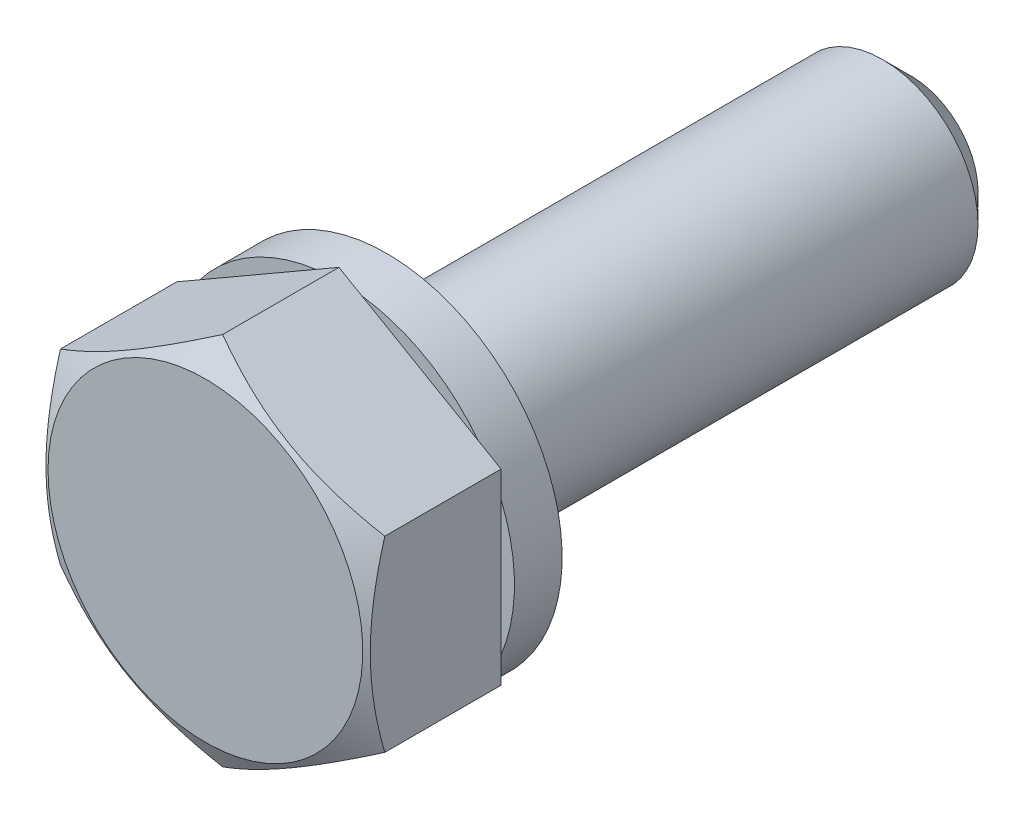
ISO-10303-21;
HEADER;
FILE_DESCRIPTION(('STEP AP214'),'2;1');
FILE_NAME('part.step','',(''),(''),'','','');
FILE_SCHEMA(('AUTOMOTIVE_DESIGN { 1 0 10303 214 1 1 1 1 }'));
ENDSEC;
DATA;
#1=APPLICATION_CONTEXT('core data for automotive mechanical design processes');
#2=APPLICATION_PROTOCOL_DEFINITION('international standard','automotive_design',2000,#1);
#3=PRODUCT_CONTEXT('',#1,'mechanical');
#4=PRODUCT('Part','Part','',(#3));
#5=PRODUCT_RELATED_PRODUCT_CATEGORY('part','',(#4));
#6=PRODUCT_DEFINITION_FORMATION('','',#4);
#7=PRODUCT_DEFINITION_CONTEXT('part definition',#1,'design');
#8=PRODUCT_DEFINITION('design','',#6,#7);
#9=PRODUCT_DEFINITION_SHAPE('','',#8);
#10=(LENGTH_UNIT() NAMED_UNIT(*) SI_UNIT(.MILLI.,.METRE.));
#11=(NAMED_UNIT(*) PLANE_ANGLE_UNIT() SI_UNIT($,.RADIAN.));
#12=(NAMED_UNIT(*) SI_UNIT($,.STERADIAN.) SOLID_ANGLE_UNIT());
#13=UNCERTAINTY_MEASURE_WITH_UNIT(LENGTH_MEASURE(1.E-05),#10,'distance_accuracy_value','');
#14=(GEOMETRIC_REPRESENTATION_CONTEXT(3) GLOBAL_UNCERTAINTY_ASSIGNED_CONTEXT((#13)) GLOBAL_UNIT_ASSIGNED_CONTEXT((#10,
#11,#12)) REPRESENTATION_CONTEXT('',''));
#15=CARTESIAN_POINT('',(0.,0.,0.));
#16=DIRECTION('',(0.,0.,1.));
#17=DIRECTION('',(1.,0.,0.));
#18=AXIS2_PLACEMENT_3D('',#15,#16,#17);
#19=CARTESIAN_POINT('',(0.,9.81495457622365,0.));
#20=DIRECTION('',(0.,0.,1.));
#21=DIRECTION('',(1.,0.,0.));
#22=AXIS2_PLACEMENT_3D('',#19,#20,#21);
#23=PLANE('',#22);
#24=CARTESIAN_POINT('',(0.,0.,0.));
#25=DIRECTION('',(0.,0.,-1.));
#26=DIRECTION('',(-1.,0.,0.));
#27=AXIS2_PLACEMENT_3D('',#24,#25,#26);
#28=CIRCLE('',#27,5.1);
#29=CARTESIAN_POINT('',(-5.1,0.,0.));
#30=VERTEX_POINT('',#29);
#31=EDGE_CURVE('E331',#30,#30,#28,.T.);
#32=ORIENTED_EDGE('',*,*,#31,.T.);
#33=EDGE_LOOP('',(#32));
#34=FACE_BOUND('',#33,.T.);
#35=CARTESIAN_POINT('',(0.,0.,0.));
#36=DIRECTION('',(0.,0.,1.));
#37=DIRECTION('',(1.,0.,0.));
#38=AXIS2_PLACEMENT_3D('',#35,#36,#37);
#39=CIRCLE('',#38,5.);
#40=CARTESIAN_POINT('',(5.,0.,0.));
#41=VERTEX_POINT('',#40);
#42=EDGE_CURVE('E175',#41,#41,#39,.F.);
#43=ORIENTED_EDGE('',*,*,#42,.F.);
#44=EDGE_LOOP('',(#43));
#45=FACE_BOUND('',#44,.T.);
#46=ADVANCED_FACE('F14',(#34,#45),#23,.F.);
#47=CARTESIAN_POINT('',(0.,0.,-30.));
#48=DIRECTION('',(0.,0.,1.));
#49=DIRECTION('',(1.,0.,0.));
#50=AXIS2_PLACEMENT_3D('',#47,#48,#49);
#51=CYLINDRICAL_SURFACE('',#50,5.);
#52=CARTESIAN_POINT('',(0.,0.,-28.5));
#53=DIRECTION('',(0.,0.,-1.));
#54=DIRECTION('',(-1.,0.,0.));
#55=AXIS2_PLACEMENT_3D('',#52,#53,#54);
#56=CIRCLE('',#55,5.);
#57=CARTESIAN_POINT('',(-5.,0.,-28.5));
#58=VERTEX_POINT('',#57);
#59=EDGE_CURVE('E9',#58,#58,#56,.F.);
#60=ORIENTED_EDGE('',*,*,#59,.T.);
#61=EDGE_LOOP('',(#60));
#62=FACE_BOUND('',#61,.T.);
#63=ORIENTED_EDGE('',*,*,#42,.T.);
#64=EDGE_LOOP('',(#63));
#65=FACE_BOUND('',#64,.T.);
#66=ADVANCED_FACE('F195',(#62,#65),#51,.T.);
#67=CARTESIAN_POINT('',(0.,0.,-30.));
#68=DIRECTION('',(0.,0.,-1.));
#69=DIRECTION('',(-1.,0.,0.));
#70=AXIS2_PLACEMENT_3D('',#67,#68,#69);
#71=PLANE('',#70);
#72=CARTESIAN_POINT('',(0.,0.,-30.));
#73=DIRECTION('',(0.,0.,-1.));
#74=DIRECTION('',(-1.,0.,0.));
#75=AXIS2_PLACEMENT_3D('',#72,#73,#74);
#76=CIRCLE('',#75,3.5);
#77=CARTESIAN_POINT('',(-3.5,0.,-30.));
#78=VERTEX_POINT('',#77);
#79=EDGE_CURVE('E22',#78,#78,#76,.T.);
#80=ORIENTED_EDGE('',*,*,#79,.T.);
#81=EDGE_LOOP('',(#80));
#82=FACE_BOUND('',#81,.T.);
#83=ADVANCED_FACE('F180',(#82),#71,.T.);
#84=CARTESIAN_POINT('',(0.,0.,-30.));
#85=DIRECTION('',(0.,0.,1.));
#86=DIRECTION('',(1.,0.,0.));
#87=AXIS2_PLACEMENT_3D('',#84,#85,#86);
#88=CONICAL_SURFACE('',#87,3.5,0.785398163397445);
#89=ORIENTED_EDGE('',*,*,#59,.F.);
#90=EDGE_LOOP('',(#89));
#91=FACE_BOUND('',#90,.T.);
#92=ORIENTED_EDGE('',*,*,#79,.F.);
#93=EDGE_LOOP('',(#92));
#94=FACE_BOUND('',#93,.T.);
#95=ADVANCED_FACE('F16',(#91,#94),#88,.T.);
#96=CARTESIAN_POINT('',(0.,0.,0.));
#97=DIRECTION('',(0.,0.,-1.));
#98=DIRECTION('',(-1.,0.,0.));
#99=AXIS2_PLACEMENT_3D('',#96,#97,#98);
#100=PLANE('',#99);
#101=CARTESIAN_POINT('',(0.,0.,0.));
#102=DIRECTION('',(0.,0.,-1.));
#103=DIRECTION('',(-1.,0.,0.));
#104=AXIS2_PLACEMENT_3D('',#101,#102,#103);
#105=CIRCLE('',#104,9.2);
#106=CARTESIAN_POINT('',(1.20163978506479,9.12118752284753,0.));
#107=VERTEX_POINT('',#106);
#108=CARTESIAN_POINT('',(7.29836021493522,5.60124434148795,0.));
#109=VERTEX_POINT('',#108);
#110=EDGE_CURVE('E233',#107,#109,#105,.T.);
#111=ORIENTED_EDGE('',*,*,#110,.F.);
#112=DIRECTION('',(0.866025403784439,-0.5,0.));
#113=VECTOR('',#112,1.);
#114=CARTESIAN_POINT('',(8.5,4.90747728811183,0.));
#115=LINE('',#114,#113);
#116=EDGE_CURVE('E237',#107,#109,#115,.T.);
#117=ORIENTED_EDGE('',*,*,#116,.T.);
#118=EDGE_LOOP('',(#111,#117));
#119=FACE_BOUND('',#118,.T.);
#120=ADVANCED_FACE('F183',(#119),#100,.F.);
#121=CARTESIAN_POINT('',(-7.29836021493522,5.60124434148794,0.));
#122=VERTEX_POINT('',#121);
#123=CARTESIAN_POINT('',(-1.20163978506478,9.12118752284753,0.));
#124=VERTEX_POINT('',#123);
#125=EDGE_CURVE('E133',#122,#124,#105,.T.);
#126=ORIENTED_EDGE('',*,*,#125,.F.);
#127=DIRECTION('',(0.866025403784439,0.5,0.));
#128=VECTOR('',#127,1.);
#129=CARTESIAN_POINT('',(0.,9.81495457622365,0.));
#130=LINE('',#129,#128);
#131=EDGE_CURVE('E111',#122,#124,#130,.T.);
#132=ORIENTED_EDGE('',*,*,#131,.T.);
#133=EDGE_LOOP('',(#126,#132));
#134=FACE_BOUND('',#133,.T.);
#135=ADVANCED_FACE('F191',(#134),#100,.F.);
#136=CARTESIAN_POINT('',(-8.5,-3.51994318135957,0.));
#137=VERTEX_POINT('',#136);
#138=CARTESIAN_POINT('',(-8.5,3.51994318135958,0.));
#139=VERTEX_POINT('',#138);
#140=EDGE_CURVE('E107',#137,#139,#105,.T.);
#141=ORIENTED_EDGE('',*,*,#140,.F.);
#142=DIRECTION('',(0.,1.,0.));
#143=VECTOR('',#142,1.);
#144=CARTESIAN_POINT('',(-8.5,4.90747728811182,0.));
#145=LINE('',#144,#143);
#146=EDGE_CURVE('E104',#137,#139,#145,.T.);
#147=ORIENTED_EDGE('',*,*,#146,.T.);
#148=EDGE_LOOP('',(#141,#147));
#149=FACE_BOUND('',#148,.T.);
#150=ADVANCED_FACE('F106',(#149),#100,.F.);
#151=CARTESIAN_POINT('',(-1.20163978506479,-9.12118752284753,0.));
#152=VERTEX_POINT('',#151);
#153=CARTESIAN_POINT('',(-7.29836021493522,-5.60124434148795,0.));
#154=VERTEX_POINT('',#153);
#155=EDGE_CURVE('E525',#152,#154,#105,.T.);
#156=ORIENTED_EDGE('',*,*,#155,.F.);
#157=DIRECTION('',(-0.866025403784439,0.5,0.));
#158=VECTOR('',#157,1.);
#159=CARTESIAN_POINT('',(-8.5,-4.90747728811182,0.));
#160=LINE('',#159,#158);
#161=EDGE_CURVE('E112',#152,#154,#160,.T.);
#162=ORIENTED_EDGE('',*,*,#161,.T.);
#163=EDGE_LOOP('',(#156,#162));
#164=FACE_BOUND('',#163,.T.);
#165=ADVANCED_FACE('F435',(#164),#100,.F.);
#166=CARTESIAN_POINT('',(7.29836021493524,-5.60124434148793,0.));
#167=VERTEX_POINT('',#166);
#168=CARTESIAN_POINT('',(1.20163978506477,-9.12118752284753,0.));
#169=VERTEX_POINT('',#168);
#170=EDGE_CURVE('E524',#167,#169,#105,.T.);
#171=ORIENTED_EDGE('',*,*,#170,.F.);
#172=DIRECTION('',(-0.866025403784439,-0.5,0.));
#173=VECTOR('',#172,1.);
#174=CARTESIAN_POINT('',(0.,-9.81495457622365,0.));
#175=LINE('',#174,#173);
#176=EDGE_CURVE('E326',#167,#169,#175,.T.);
#177=ORIENTED_EDGE('',*,*,#176,.T.);
#178=EDGE_LOOP('',(#171,#177));
#179=FACE_BOUND('',#178,.T.);
#180=ADVANCED_FACE('F350',(#179),#100,.F.);
#181=CARTESIAN_POINT('',(8.5,3.5199431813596,0.));
#182=VERTEX_POINT('',#181);
#183=CARTESIAN_POINT('',(8.5,-3.5199431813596,0.));
#184=VERTEX_POINT('',#183);
#185=EDGE_CURVE('E234',#182,#184,#105,.T.);
#186=ORIENTED_EDGE('',*,*,#185,.F.);
#187=DIRECTION('',(0.,1.,0.));
#188=VECTOR('',#187,1.);
#189=CARTESIAN_POINT('',(8.5,-4.90747728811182,0.));
#190=LINE('',#189,#188);
#191=EDGE_CURVE('E159',#184,#182,#190,.T.);
#192=ORIENTED_EDGE('',*,*,#191,.F.);
#193=EDGE_LOOP('',(#186,#192));
#194=FACE_BOUND('',#193,.T.);
#195=ADVANCED_FACE('F194',(#194),#100,.F.);
#196=CARTESIAN_POINT('',(0.,0.,-2.5));
#197=DIRECTION('',(0.,0.,-1.));
#198=DIRECTION('',(-1.,0.,0.));
#199=AXIS2_PLACEMENT_3D('',#196,#197,#198);
#200=PLANE('',#199);
#201=CARTESIAN_POINT('',(0.,0.,-2.5));
#202=DIRECTION('',(0.,0.,-1.));
#203=DIRECTION('',(-1.,0.,0.));
#204=AXIS2_PLACEMENT_3D('',#201,#202,#203);
#205=CIRCLE('',#204,9.2);
#206=CARTESIAN_POINT('',(-9.2,0.,-2.5));
#207=VERTEX_POINT('',#206);
#208=EDGE_CURVE('E132',#207,#207,#205,.T.);
#209=ORIENTED_EDGE('',*,*,#208,.T.);
#210=EDGE_LOOP('',(#209));
#211=FACE_BOUND('',#210,.T.);
#212=CARTESIAN_POINT('',(0.,0.,-2.5));
#213=DIRECTION('',(0.,0.,-1.));
#214=DIRECTION('',(-1.,0.,0.));
#215=AXIS2_PLACEMENT_3D('',#212,#213,#214);
#216=CIRCLE('',#215,5.1);
#217=CARTESIAN_POINT('',(-5.1,0.,-2.5));
#218=VERTEX_POINT('',#217);
#219=EDGE_CURVE('E124',#218,#218,#216,.T.);
#220=ORIENTED_EDGE('',*,*,#219,.F.);
#221=EDGE_LOOP('',(#220));
#222=FACE_BOUND('',#221,.T.);
#223=ADVANCED_FACE('F339',(#211,#222),#200,.T.);
#224=CARTESIAN_POINT('',(0.,0.,-2.5));
#225=DIRECTION('',(0.,0.,1.));
#226=DIRECTION('',(1.,0.,0.));
#227=AXIS2_PLACEMENT_3D('',#224,#225,#226);
#228=CYLINDRICAL_SURFACE('',#227,9.2);
#229=ORIENTED_EDGE('',*,*,#208,.F.);
#230=EDGE_LOOP('',(#229));
#231=FACE_BOUND('',#230,.T.);
#232=EDGE_CURVE('E118',#139,#122,#105,.T.);
#233=ORIENTED_EDGE('',*,*,#232,.T.);
#234=ORIENTED_EDGE('',*,*,#125,.T.);
#235=EDGE_CURVE('E539',#124,#107,#105,.T.);
#236=ORIENTED_EDGE('',*,*,#235,.T.);
#237=ORIENTED_EDGE('',*,*,#110,.T.);
#238=EDGE_CURVE('E29',#109,#182,#105,.T.);
#239=ORIENTED_EDGE('',*,*,#238,.T.);
#240=ORIENTED_EDGE('',*,*,#185,.T.);
#241=EDGE_CURVE('E530',#184,#167,#105,.T.);
#242=ORIENTED_EDGE('',*,*,#241,.T.);
#243=ORIENTED_EDGE('',*,*,#170,.T.);
#244=EDGE_CURVE('E522',#169,#152,#105,.T.);
#245=ORIENTED_EDGE('',*,*,#244,.T.);
#246=ORIENTED_EDGE('',*,*,#155,.T.);
#247=EDGE_CURVE('E122',#154,#137,#105,.T.);
#248=ORIENTED_EDGE('',*,*,#247,.T.);
#249=ORIENTED_EDGE('',*,*,#140,.T.);
#250=EDGE_LOOP('',(#233,#234,#236,#237,#239,#240,#242,#243,#245,#246,#248,#249));
#251=FACE_BOUND('',#250,.T.);
#252=ADVANCED_FACE('F116',(#231,#251),#228,.T.);
#253=CARTESIAN_POINT('',(0.,0.,-2.5));
#254=DIRECTION('',(0.,0.,1.));
#255=DIRECTION('',(1.,0.,0.));
#256=AXIS2_PLACEMENT_3D('',#253,#254,#255);
#257=CYLINDRICAL_SURFACE('',#256,5.1);
#258=ORIENTED_EDGE('',*,*,#219,.T.);
#259=EDGE_LOOP('',(#258));
#260=FACE_BOUND('',#259,.T.);
#261=ORIENTED_EDGE('',*,*,#31,.F.);
#262=EDGE_LOOP('',(#261));
#263=FACE_BOUND('',#262,.T.);
#264=ADVANCED_FACE('F336',(#260,#263),#257,.F.);
#265=CARTESIAN_POINT('',(0.,9.81495457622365,7.));
#266=DIRECTION('',(0.,0.,1.));
#267=DIRECTION('',(1.,0.,0.));
#268=AXIS2_PLACEMENT_3D('',#265,#266,#267);
#269=PLANE('',#268);
#270=CARTESIAN_POINT('',(0.,0.,7.));
#271=DIRECTION('',(0.,0.,-1.));
#272=DIRECTION('',(-1.,0.,0.));
#273=AXIS2_PLACEMENT_3D('',#270,#271,#272);
#274=CIRCLE('',#273,8.25);
#275=CARTESIAN_POINT('',(-8.25,0.,7.));
#276=VERTEX_POINT('',#275);
#277=EDGE_CURVE('E309',#276,#276,#274,.T.);
#278=ORIENTED_EDGE('',*,*,#277,.F.);
#279=EDGE_LOOP('',(#278));
#280=FACE_BOUND('',#279,.T.);
#281=ADVANCED_FACE('F261',(#280),#269,.T.);
#282=CARTESIAN_POINT('',(0.,0.,7.));
#283=DIRECTION('',(0.,0.,-1.));
#284=DIRECTION('',(-1.,0.,0.));
#285=AXIS2_PLACEMENT_3D('',#282,#283,#284);
#286=CONICAL_SURFACE('',#285,8.25,1.0471975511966);
#287=ORIENTED_EDGE('',*,*,#277,.T.);
#288=EDGE_LOOP('',(#287));
#289=FACE_BOUND('',#288,.T.);
#290=CARTESIAN_POINT('',(-8.5002,4.90736181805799,6.09640638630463));
#291=CARTESIAN_POINT('',(-8.31336077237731,5.01523349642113,6.15867629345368));
#292=CARTESIAN_POINT('',(-8.1258249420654,5.12350735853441,6.21812013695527));
#293=CARTESIAN_POINT('',(-7.74923024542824,5.34093440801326,6.33057732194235));
#294=CARTESIAN_POINT('',(-7.56017075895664,5.4500879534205,6.38358788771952));
#295=CARTESIAN_POINT('',(-6.98996524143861,5.77929626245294,6.53192904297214));
#296=CARTESIAN_POINT('',(-6.60656835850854,6.00065055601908,6.61630350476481));
#297=CARTESIAN_POINT('',(-6.03282233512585,6.33190297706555,6.71524241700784));
#298=CARTESIAN_POINT('',(-5.84418723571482,6.44081150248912,6.7434272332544));
#299=CARTESIAN_POINT('',(-5.4660639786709,6.65912106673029,6.79068834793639));
#300=CARTESIAN_POINT('',(-5.27657589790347,6.76852206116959,6.80976545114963));
#301=CARTESIAN_POINT('',(-4.89727347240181,6.98751241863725,6.83832766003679));
#302=CARTESIAN_POINT('',(-4.70745974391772,7.09710142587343,6.84782365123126));
#303=CARTESIAN_POINT('',(-4.32765694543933,7.3163806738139,6.85702005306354));
#304=CARTESIAN_POINT('',(-4.13766788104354,7.42607091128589,6.85672076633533));
#305=CARTESIAN_POINT('',(-3.78247698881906,7.63114046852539,6.84700795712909));
#306=CARTESIAN_POINT('',(-3.61725009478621,7.72653426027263,6.83877926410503));
#307=CARTESIAN_POINT('',(-3.28718328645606,7.9170984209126,6.81507319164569));
#308=CARTESIAN_POINT('',(-3.12234339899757,8.01226877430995,6.79959532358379));
#309=CARTESIAN_POINT('',(-2.6284618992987,8.29741139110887,6.74265381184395));
#310=CARTESIAN_POINT('',(-2.3002944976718,8.48687892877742,6.69068937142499));
#311=CARTESIAN_POINT('',(-1.64047857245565,8.86782383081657,6.56077749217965));
#312=CARTESIAN_POINT('',(-1.30891425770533,9.05925257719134,6.48227936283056));
#313=CARTESIAN_POINT('',(-0.650730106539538,9.43925537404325,6.30412109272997));
#314=CARTESIAN_POINT('',(-0.32410184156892,9.62783429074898,6.20450279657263));
#315=CARTESIAN_POINT('',(0.000200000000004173,9.81507004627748,6.09640638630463));
#316=B_SPLINE_CURVE_WITH_KNOTS('',3,(#290,#291,#292,#293,#294,#295,#296,#297,#298,#299,#300,
#301,#302,#303,#304,#305,#306,#307,#308,#309,#310,#311,#312,#313,#314,#315),.UNSPECIFIED.,.F.,
.F.,(4,2,2,2,2,2,2,2,2,2,2,2,4),(0.,0.673596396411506,1.34748239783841,2.69805431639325,
3.35679995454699,4.01548737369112,4.67342558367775,5.33134346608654,5.90409556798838,
6.47688628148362,7.62328361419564,8.79510569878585,9.9646274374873),.UNSPECIFIED.);
#317=CARTESIAN_POINT('',(-8.5,4.90747728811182,6.09647305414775));
#318=VERTEX_POINT('',#317);
#319=CARTESIAN_POINT('',(0.,9.81495457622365,6.09647305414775));
#320=VERTEX_POINT('',#319);
#321=EDGE_CURVE('E249',#318,#320,#316,.T.);
#322=ORIENTED_EDGE('',*,*,#321,.F.);
#323=CARTESIAN_POINT('',(-8.5,-13.1026642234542,2.74593746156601));
#324=CARTESIAN_POINT('',(-8.5,-12.7320710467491,2.92538754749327));
#325=CARTESIAN_POINT('',(-8.50000000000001,-12.3606185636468,3.1030938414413));
#326=CARTESIAN_POINT('',(-8.50000000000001,-11.6155376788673,3.45403645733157));
#327=CARTESIAN_POINT('',(-8.50000000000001,-11.2419089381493,3.62727205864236));
#328=CARTESIAN_POINT('',(-8.50000000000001,-10.4900547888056,3.96917951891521));
#329=CARTESIAN_POINT('',(-8.50000000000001,-10.1118153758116,4.13782069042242));
#330=CARTESIAN_POINT('',(-8.50000000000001,-9.35230025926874,4.46809461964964));
#331=CARTESIAN_POINT('',(-8.50000000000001,-8.97102470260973,4.62972771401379));
#332=CARTESIAN_POINT('',(-8.50000000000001,-8.19283605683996,4.94905443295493));
#333=CARTESIAN_POINT('',(-8.50000000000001,-7.79580686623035,5.10646670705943));
#334=CARTESIAN_POINT('',(-8.50000000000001,-6.99707523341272,5.4091842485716));
#335=CARTESIAN_POINT('',(-8.5,-6.59537226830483,5.55448814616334));
#336=CARTESIAN_POINT('',(-8.5,-5.7874270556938,5.82911560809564));
#337=CARTESIAN_POINT('',(-8.50000000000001,-5.38119616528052,5.95847222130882));
#338=CARTESIAN_POINT('',(-8.5,-4.5629229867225,6.1970038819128));
#339=CARTESIAN_POINT('',(-8.5,-4.15088259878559,6.30618537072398));
#340=CARTESIAN_POINT('',(-8.5,-3.32295792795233,6.49849151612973));
#341=CARTESIAN_POINT('',(-8.5,-2.90710664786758,6.58175438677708));
#342=CARTESIAN_POINT('',(-8.5,-2.27960724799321,6.68356538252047));
#343=CARTESIAN_POINT('',(-8.5,-2.06980434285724,6.71365656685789));
#344=CARTESIAN_POINT('',(-8.5,-1.64918293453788,6.76555254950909));
#345=CARTESIAN_POINT('',(-8.5,-1.43836453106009,6.78735814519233));
#346=CARTESIAN_POINT('',(-8.5,-1.01871348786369,6.82197913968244));
#347=CARTESIAN_POINT('',(-8.5,-0.809890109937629,6.83490638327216));
#348=CARTESIAN_POINT('',(-8.5,-0.39188410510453,6.85192420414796));
#349=CARTESIAN_POINT('',(-8.5,-0.182701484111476,6.85601492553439));
#350=CARTESIAN_POINT('',(-8.5,0.235650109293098,6.85526233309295));
#351=CARTESIAN_POINT('',(-8.5,0.444819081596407,6.85041895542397));
#352=CARTESIAN_POINT('',(-8.5,0.86276947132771,6.83191500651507));
#353=CARTESIAN_POINT('',(-8.5,1.07155086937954,6.81825400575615));
#354=CARTESIAN_POINT('',(-8.5,1.57574896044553,6.77490263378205));
#355=CARTESIAN_POINT('',(-8.5,1.87080068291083,6.74089371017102));
#356=CARTESIAN_POINT('',(-8.5,2.45866338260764,6.65713713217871));
#357=CARTESIAN_POINT('',(-8.5,2.75147403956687,6.60738726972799));
#358=CARTESIAN_POINT('',(-8.5,3.33459303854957,6.49391875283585));
#359=CARTESIAN_POINT('',(-8.5,3.62489919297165,6.43018896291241));
#360=CARTESIAN_POINT('',(-8.5,4.20257464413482,6.29070067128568));
#361=CARTESIAN_POINT('',(-8.5,4.48994399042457,6.21494237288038));
#362=CARTESIAN_POINT('',(-8.5,5.0680151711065,6.05145913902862));
#363=CARTESIAN_POINT('',(-8.5,5.35865292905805,5.96350918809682));
#364=CARTESIAN_POINT('',(-8.5,5.93706457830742,5.77869577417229));
#365=CARTESIAN_POINT('',(-8.5,6.22483845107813,5.68183225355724));
#366=CARTESIAN_POINT('',(-8.5,6.79766756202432,5.48071443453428));
#367=CARTESIAN_POINT('',(-8.5,7.08272370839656,5.3764627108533));
#368=CARTESIAN_POINT('',(-8.5,7.65048563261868,5.1617779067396));
#369=CARTESIAN_POINT('',(-8.5,7.93319143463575,5.05134488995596));
#370=CARTESIAN_POINT('',(-8.5,8.58625691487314,4.78932204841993));
#371=CARTESIAN_POINT('',(-8.5,8.95585125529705,4.63582786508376));
#372=CARTESIAN_POINT('',(-8.5,9.69201525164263,4.32173022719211));
#373=CARTESIAN_POINT('',(-8.5,10.0585847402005,4.16112638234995));
#374=CARTESIAN_POINT('',(-8.5,10.7892442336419,3.83419501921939));
#375=CARTESIAN_POINT('',(-8.5,11.1533337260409,3.66786635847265));
#376=CARTESIAN_POINT('',(-8.5,11.879361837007,3.33060757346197));
#377=CARTESIAN_POINT('',(-8.5,12.2413004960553,3.15967753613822));
#378=CARTESIAN_POINT('',(-8.5,12.9637389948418,2.81388116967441));
#379=CARTESIAN_POINT('',(-8.5,13.3242370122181,2.63901103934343));
#380=CARTESIAN_POINT('',(-8.5,14.0437060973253,2.28615454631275));
#381=CARTESIAN_POINT('',(-8.5,14.4026771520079,2.10816815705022));
#382=CARTESIAN_POINT('',(-8.5,15.4775690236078,1.57038636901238));
#383=CARTESIAN_POINT('',(-8.5,16.1915560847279,1.20672611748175));
#384=CARTESIAN_POINT('',(-8.5,17.5583767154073,0.501692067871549));
#385=CARTESIAN_POINT('',(-8.49999999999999,18.2115029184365,0.160883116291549));
#386=CARTESIAN_POINT('',(-8.49999999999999,19.515315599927,-0.525416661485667));
#387=CARTESIAN_POINT('',(-8.49999999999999,20.1660019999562,-0.870907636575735));
#388=CARTESIAN_POINT('',(-8.49999999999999,21.4639477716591,-1.56466133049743));
#389=CARTESIAN_POINT('',(-8.49999999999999,22.1112115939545,-1.91291573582));
#390=CARTESIAN_POINT('',(-8.49999999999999,23.4041708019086,-2.6122458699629));
#391=CARTESIAN_POINT('',(-8.49999999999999,24.0498662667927,-2.96332145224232));
#392=CARTESIAN_POINT('',(-8.5,24.69498034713,-3.3154549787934));
#393=B_SPLINE_CURVE_WITH_KNOTS('',3,(#323,#324,#325,#326,#327,#328,#329,#330,#331,#332,#333,
#334,#335,#336,#337,#338,#339,#340,#341,#342,#343,#344,#345,#346,#347,#348,#349,#350,#351,#352,
#353,#354,#355,#356,#357,#358,#359,#360,#361,#362,#363,#364,#365,#366,#367,#368,#369,#370,#371,
#372,#373,#374,#375,#376,#377,#378,#379,#380,#381,#382,#383,#384,#385,#386,#387,#388,#389,#390,
#391,#392),.UNSPECIFIED.,.F.,.F.,(4,2,2,2,2,2,2,2,2,2,2,2,2,2,2,2,2,2,2,2,2,2,2,2,2,2,2,2,2,2,2,
2,2,2,4),(0.,1.23527849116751,2.47075486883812,3.71309244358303,4.95537027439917,
6.23650441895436,7.51778330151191,8.79636058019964,10.0745289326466,11.3457596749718,
11.9814713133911,12.6171217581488,13.2446100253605,13.8720880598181,14.4995705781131,
15.1270836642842,16.017604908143,16.9082511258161,17.7996093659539,18.690952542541,
19.6017420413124,20.5125374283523,21.4230169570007,22.3334871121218,23.5339891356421,
24.7345571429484,25.9353661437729,27.1361524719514,28.3381515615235,29.5401609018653,
31.9438880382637,34.1539630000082,36.3641084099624,38.569114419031,40.774006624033),.UNSPECIFIED.);
#394=CARTESIAN_POINT('',(-8.5,-4.90747728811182,6.09647305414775));
#395=VERTEX_POINT('',#394);
#396=EDGE_CURVE('E288',#395,#318,#393,.T.);
#397=ORIENTED_EDGE('',*,*,#396,.F.);
#398=CARTESIAN_POINT('',(0.000199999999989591,-9.81507004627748,6.09640638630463));
#399=CARTESIAN_POINT('',(-0.186639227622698,-9.70719836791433,6.15867629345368));
#400=CARTESIAN_POINT('',(-0.374175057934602,-9.59892450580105,6.21812013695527));
#401=CARTESIAN_POINT('',(-0.750769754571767,-9.3814974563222,6.33057732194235));
#402=CARTESIAN_POINT('',(-0.939829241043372,-9.27234391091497,6.38358788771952));
#403=CARTESIAN_POINT('',(-1.5100347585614,-8.94313560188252,6.53192904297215));
#404=CARTESIAN_POINT('',(-1.89343164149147,-8.72178130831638,6.61630350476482));
#405=CARTESIAN_POINT('',(-2.46717766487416,-8.39052888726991,6.71524241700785));
#406=CARTESIAN_POINT('',(-2.65581276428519,-8.28162036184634,6.7434272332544));
#407=CARTESIAN_POINT('',(-3.03393602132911,-8.06331079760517,6.7906883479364));
#408=CARTESIAN_POINT('',(-3.22342410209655,-7.95390980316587,6.80976545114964));
#409=CARTESIAN_POINT('',(-3.6027265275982,-7.73491944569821,6.8383276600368));
#410=CARTESIAN_POINT('',(-3.79254025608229,-7.62533043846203,6.84782365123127));
#411=CARTESIAN_POINT('',(-4.17234305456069,-7.40605119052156,6.85702005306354));
#412=CARTESIAN_POINT('',(-4.36233211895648,-7.29636095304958,6.85672076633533));
#413=CARTESIAN_POINT('',(-4.71752301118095,-7.09129139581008,6.84700795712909));
#414=CARTESIAN_POINT('',(-4.8827499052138,-6.99589760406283,6.83877926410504));
#415=CARTESIAN_POINT('',(-5.21281671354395,-6.80533344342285,6.81507319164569));
#416=CARTESIAN_POINT('',(-5.37765660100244,-6.71016309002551,6.79959532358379));
#417=CARTESIAN_POINT('',(-5.87153810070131,-6.42502047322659,6.74265381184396));
#418=CARTESIAN_POINT('',(-6.19970550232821,-6.23555293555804,6.69068937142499));
#419=CARTESIAN_POINT('',(-6.85952142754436,-5.8546080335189,6.56077749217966));
#420=CARTESIAN_POINT('',(-7.19108574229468,-5.66317928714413,6.48227936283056));
#421=CARTESIAN_POINT('',(-7.84926989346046,-5.28317649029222,6.30412109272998));
#422=CARTESIAN_POINT('',(-8.17589815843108,-5.09459757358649,6.20450279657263));
#423=CARTESIAN_POINT('',(-8.5002,-4.90736181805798,6.09640638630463));
#424=B_SPLINE_CURVE_WITH_KNOTS('',3,(#398,#399,#400,#401,#402,#403,#404,#405,#406,#407,#408,
#409,#410,#411,#412,#413,#414,#415,#416,#417,#418,#419,#420,#421,#422,#423),.UNSPECIFIED.,.F.,
.F.,(4,2,2,2,2,2,2,2,2,2,2,2,4),(0.,0.673596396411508,1.34748239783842,2.69805431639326,
3.35679995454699,4.01548737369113,4.67342558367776,5.33134346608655,5.90409556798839,
6.47688628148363,7.62328361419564,8.79510569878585,9.96462743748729),.UNSPECIFIED.);
#425=CARTESIAN_POINT('',(0.,-9.81495457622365,6.09647305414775));
#426=VERTEX_POINT('',#425);
#427=EDGE_CURVE('E282',#426,#395,#424,.T.);
#428=ORIENTED_EDGE('',*,*,#427,.F.);
#429=CARTESIAN_POINT('',(8.5002,-4.90736181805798,6.09640638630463));
#430=CARTESIAN_POINT('',(8.31336077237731,-5.01523349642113,6.15867629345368));
#431=CARTESIAN_POINT('',(8.12582494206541,-5.12350735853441,6.21812013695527));
#432=CARTESIAN_POINT('',(7.74923024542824,-5.34093440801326,6.33057732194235));
#433=CARTESIAN_POINT('',(7.56017075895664,-5.45008795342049,6.38358788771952));
#434=CARTESIAN_POINT('',(6.98996524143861,-5.77929626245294,6.53192904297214));
#435=CARTESIAN_POINT('',(6.60656835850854,-6.00065055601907,6.61630350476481));
#436=CARTESIAN_POINT('',(6.03282233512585,-6.33190297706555,6.71524241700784));
#437=CARTESIAN_POINT('',(5.84418723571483,-6.44081150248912,6.7434272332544));
#438=CARTESIAN_POINT('',(5.4660639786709,-6.65912106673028,6.7906883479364));
#439=CARTESIAN_POINT('',(5.27657589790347,-6.76852206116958,6.80976545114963));
#440=CARTESIAN_POINT('',(4.89727347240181,-6.98751241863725,6.83832766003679));
#441=CARTESIAN_POINT('',(4.70745974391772,-7.09710142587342,6.84782365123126));
#442=CARTESIAN_POINT('',(4.32765694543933,-7.31638067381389,6.85702005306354));
#443=CARTESIAN_POINT('',(4.13766788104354,-7.42607091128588,6.85672076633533));
#444=CARTESIAN_POINT('',(3.78247698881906,-7.63114046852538,6.84700795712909));
#445=CARTESIAN_POINT('',(3.61725009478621,-7.72653426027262,6.83877926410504));
#446=CARTESIAN_POINT('',(3.28718328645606,-7.9170984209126,6.81507319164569));
#447=CARTESIAN_POINT('',(3.12234339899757,-8.01226877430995,6.79959532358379));
#448=CARTESIAN_POINT('',(2.6284618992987,-8.29741139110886,6.74265381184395));
#449=CARTESIAN_POINT('',(2.30029449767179,-8.48687892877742,6.69068937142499));
#450=CARTESIAN_POINT('',(1.64047857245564,-8.86782383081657,6.56077749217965));
#451=CARTESIAN_POINT('',(1.30891425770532,-9.05925257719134,6.48227936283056));
#452=CARTESIAN_POINT('',(0.650730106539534,-9.43925537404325,6.30412109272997));
#453=CARTESIAN_POINT('',(0.324101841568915,-9.62783429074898,6.20450279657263));
#454=CARTESIAN_POINT('',(-0.000200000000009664,-9.81507004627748,6.09640638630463));
#455=B_SPLINE_CURVE_WITH_KNOTS('',3,(#429,#430,#431,#432,#433,#434,#435,#436,#437,#438,#439,
#440,#441,#442,#443,#444,#445,#446,#447,#448,#449,#450,#451,#452,#453,#454),.UNSPECIFIED.,.F.,
.F.,(4,2,2,2,2,2,2,2,2,2,2,2,4),(0.,0.673596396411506,1.34748239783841,2.69805431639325,
3.35679995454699,4.01548737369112,4.67342558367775,5.33134346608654,5.90409556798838,
6.47688628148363,7.62328361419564,8.79510569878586,9.96462743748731),.UNSPECIFIED.);
#456=CARTESIAN_POINT('',(8.5,-4.90747728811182,6.09647305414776));
#457=VERTEX_POINT('',#456);
#458=EDGE_CURVE('E37',#457,#426,#455,.T.);
#459=ORIENTED_EDGE('',*,*,#458,.F.);
#460=CARTESIAN_POINT('',(8.5,-13.1026642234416,2.74593746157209));
#461=CARTESIAN_POINT('',(8.5,-12.732071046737,2.9253875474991));
#462=CARTESIAN_POINT('',(8.5,-12.3606185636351,3.10309384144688));
#463=CARTESIAN_POINT('',(8.5,-11.6155376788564,3.45403645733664));
#464=CARTESIAN_POINT('',(8.5,-11.2419089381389,3.62727205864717));
#465=CARTESIAN_POINT('',(8.5,-10.490054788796,3.96917951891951));
#466=CARTESIAN_POINT('',(8.5,-10.1118153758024,4.13782069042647));
#467=CARTESIAN_POINT('',(8.5,-9.35230025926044,4.46809461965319));
#468=CARTESIAN_POINT('',(8.5,-8.97102470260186,4.62972771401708));
#469=CARTESIAN_POINT('',(8.5,-8.19283605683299,4.94905443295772));
#470=CARTESIAN_POINT('',(8.5,-7.79580686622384,5.10646670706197));
#471=CARTESIAN_POINT('',(8.5,-6.99707523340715,5.40918424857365));
#472=CARTESIAN_POINT('',(8.5,-6.59537226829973,5.55448814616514));
#473=CARTESIAN_POINT('',(8.5,-5.78742705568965,5.82911560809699));
#474=CARTESIAN_POINT('',(8.5,-5.38119616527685,5.95847222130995));
#475=CARTESIAN_POINT('',(8.5,-4.56292298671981,6.19700388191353));
#476=CARTESIAN_POINT('',(8.5,-4.1508825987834,6.30618537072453));
#477=CARTESIAN_POINT('',(8.5,-3.32295792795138,6.49849151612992));
#478=CARTESIAN_POINT('',(8.5,-2.90710664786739,6.5817543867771));
#479=CARTESIAN_POINT('',(8.5,-2.27960724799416,6.68356538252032));
#480=CARTESIAN_POINT('',(8.5,-2.06980434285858,6.7136565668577));
#481=CARTESIAN_POINT('',(8.5,-1.64918293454,6.76555254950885));
#482=CARTESIAN_POINT('',(8.5,-1.43836453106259,6.78735814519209));
#483=CARTESIAN_POINT('',(8.5,-1.01871348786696,6.82197913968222));
#484=CARTESIAN_POINT('',(8.5,-0.809890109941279,6.83490638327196));
#485=CARTESIAN_POINT('',(8.5,-0.391884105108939,6.85192420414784));
#486=CARTESIAN_POINT('',(8.5,-0.182701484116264,6.85601492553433));
#487=CARTESIAN_POINT('',(8.5,0.235650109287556,6.85526233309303));
#488=CARTESIAN_POINT('',(8.5,0.444819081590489,6.85041895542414));
#489=CARTESIAN_POINT('',(8.5,0.862769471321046,6.83191500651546));
#490=CARTESIAN_POINT('',(8.5,1.0715508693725,6.81825400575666));
#491=CARTESIAN_POINT('',(8.5,1.57574896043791,6.77490263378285));
#492=CARTESIAN_POINT('',(8.5,1.870800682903,6.74089371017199));
#493=CARTESIAN_POINT('',(8.5,2.45866338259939,6.65713713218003));
#494=CARTESIAN_POINT('',(8.5,2.75147403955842,6.60738726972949));
#495=CARTESIAN_POINT('',(8.5,3.33459303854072,6.49391875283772));
#496=CARTESIAN_POINT('',(8.5,3.6248991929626,6.43018896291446));
#497=CARTESIAN_POINT('',(8.5,4.20257464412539,6.2907006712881));
#498=CARTESIAN_POINT('',(8.5,4.48994399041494,6.21494237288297));
#499=CARTESIAN_POINT('',(8.5,5.06801517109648,6.05145913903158));
#500=CARTESIAN_POINT('',(8.5,5.35865292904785,5.96350918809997));
#501=CARTESIAN_POINT('',(8.5,5.93706457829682,5.7786957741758));
#502=CARTESIAN_POINT('',(8.5,6.22483845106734,5.68183225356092));
#503=CARTESIAN_POINT('',(8.5,6.79766756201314,5.48071443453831));
#504=CARTESIAN_POINT('',(8.5,7.08272370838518,5.3764627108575));
#505=CARTESIAN_POINT('',(8.5,7.65048563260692,5.16177790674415));
#506=CARTESIAN_POINT('',(8.5,7.93319143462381,5.05134488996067));
#507=CARTESIAN_POINT('',(8.5,8.58625691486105,4.7893220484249));
#508=CARTESIAN_POINT('',(8.5,8.95585125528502,4.63582786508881));
#509=CARTESIAN_POINT('',(8.5,9.6920152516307,4.3217302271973));
#510=CARTESIAN_POINT('',(8.5,10.0585847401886,4.16112638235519));
#511=CARTESIAN_POINT('',(8.5,10.7892442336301,3.83419501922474));
#512=CARTESIAN_POINT('',(8.5,11.1533337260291,3.66786635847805));
#513=CARTESIAN_POINT('',(8.5,11.8793618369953,3.33060757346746));
#514=CARTESIAN_POINT('',(8.5,12.2413004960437,3.15967753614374));
#515=CARTESIAN_POINT('',(8.5,12.9637389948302,2.81388116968));
#516=CARTESIAN_POINT('',(8.5,13.3242370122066,2.63901103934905));
#517=CARTESIAN_POINT('',(8.5,14.0437060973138,2.28615454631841));
#518=CARTESIAN_POINT('',(8.5,14.4026771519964,2.1081681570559));
#519=CARTESIAN_POINT('',(8.5,15.4775690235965,1.57038636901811));
#520=CARTESIAN_POINT('',(8.5,16.1915560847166,1.20672611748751));
#521=CARTESIAN_POINT('',(8.5,17.5583767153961,0.501692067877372));
#522=CARTESIAN_POINT('',(8.5,18.2115029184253,0.160883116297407));
#523=CARTESIAN_POINT('',(8.5,19.5153155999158,-0.525416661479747));
#524=CARTESIAN_POINT('',(8.5,20.166001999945,-0.870907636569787));
#525=CARTESIAN_POINT('',(8.5,21.4639477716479,-1.56466133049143));
#526=CARTESIAN_POINT('',(8.5,22.1112115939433,-1.91291573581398));
#527=CARTESIAN_POINT('',(8.5,23.4041708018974,-2.61224586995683));
#528=CARTESIAN_POINT('',(8.5,24.0498662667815,-2.96332145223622));
#529=CARTESIAN_POINT('',(8.5,24.6949803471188,-3.31545497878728));
#530=B_SPLINE_CURVE_WITH_KNOTS('',3,(#460,#461,#462,#463,#464,#465,#466,#467,#468,#469,#470,
#471,#472,#473,#474,#475,#476,#477,#478,#479,#480,#481,#482,#483,#484,#485,#486,#487,#488,#489,
#490,#491,#492,#493,#494,#495,#496,#497,#498,#499,#500,#501,#502,#503,#504,#505,#506,#507,#508,
#509,#510,#511,#512,#513,#514,#515,#516,#517,#518,#519,#520,#521,#522,#523,#524,#525,#526,#527,
#528,#529),.UNSPECIFIED.,.F.,.F.,(4,2,2,2,2,2,2,2,2,2,2,2,2,2,2,2,2,2,2,2,2,2,2,2,2,2,2,2,2,2,2,
2,2,2,4),(0.,1.23527849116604,2.47075486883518,3.7130924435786,4.95537027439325,
6.23650441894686,7.51778330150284,8.796360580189,10.0745289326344,11.3457596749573,
11.9814713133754,12.617121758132,13.2446100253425,13.872088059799,14.4995705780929,
15.1270836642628,16.0176049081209,16.9082511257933,17.7996093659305,18.6909525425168,
19.6017420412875,20.5125374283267,21.4230169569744,22.3334871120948,23.5339891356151,
24.7345571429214,25.9353661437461,27.1361524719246,28.3381515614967,29.5401609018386,
31.9438880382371,34.1539629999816,36.3641084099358,38.5691144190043,40.7740066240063),.UNSPECIFIED.);
#531=CARTESIAN_POINT('',(8.5,4.90747728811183,6.09647305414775));
#532=VERTEX_POINT('',#531);
#533=EDGE_CURVE('E266',#532,#457,#530,.F.);
#534=ORIENTED_EDGE('',*,*,#533,.F.);
#535=CARTESIAN_POINT('',(-0.00019999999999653,9.81507004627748,6.09640638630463));
#536=CARTESIAN_POINT('',(0.186639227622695,9.70719836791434,6.15867629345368));
#537=CARTESIAN_POINT('',(0.374175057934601,9.59892450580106,6.21812013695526));
#538=CARTESIAN_POINT('',(0.750769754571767,9.38149745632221,6.33057732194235));
#539=CARTESIAN_POINT('',(0.939829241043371,9.27234391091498,6.38358788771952));
#540=CARTESIAN_POINT('',(1.5100347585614,8.94313560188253,6.53192904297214));
#541=CARTESIAN_POINT('',(1.89343164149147,8.72178130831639,6.61630350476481));
#542=CARTESIAN_POINT('',(2.46717766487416,8.39052888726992,6.71524241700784));
#543=CARTESIAN_POINT('',(2.65581276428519,8.28162036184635,6.7434272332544));
#544=CARTESIAN_POINT('',(3.03393602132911,8.06331079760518,6.79068834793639));
#545=CARTESIAN_POINT('',(3.22342410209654,7.95390980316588,6.80976545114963));
#546=CARTESIAN_POINT('',(3.6027265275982,7.73491944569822,6.83832766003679));
#547=CARTESIAN_POINT('',(3.79254025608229,7.62533043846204,6.84782365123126));
#548=CARTESIAN_POINT('',(4.17234305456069,7.40605119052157,6.85702005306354));
#549=CARTESIAN_POINT('',(4.36233211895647,7.29636095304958,6.85672076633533));
#550=CARTESIAN_POINT('',(4.71752301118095,7.09129139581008,6.84700795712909));
#551=CARTESIAN_POINT('',(4.8827499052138,6.99589760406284,6.83877926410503));
#552=CARTESIAN_POINT('',(5.21281671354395,6.80533344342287,6.81507319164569));
#553=CARTESIAN_POINT('',(5.37765660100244,6.71016309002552,6.79959532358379));
#554=CARTESIAN_POINT('',(5.87153810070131,6.4250204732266,6.74265381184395));
#555=CARTESIAN_POINT('',(6.19970550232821,6.23555293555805,6.69068937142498));
#556=CARTESIAN_POINT('',(6.85952142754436,5.85460803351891,6.56077749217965));
#557=CARTESIAN_POINT('',(7.19108574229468,5.66317928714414,6.48227936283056));
#558=CARTESIAN_POINT('',(7.84926989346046,5.28317649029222,6.30412109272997));
#559=CARTESIAN_POINT('',(8.17589815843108,5.0945975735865,6.20450279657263));
#560=CARTESIAN_POINT('',(8.5002,4.90736181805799,6.09640638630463));
#561=B_SPLINE_CURVE_WITH_KNOTS('',3,(#535,#536,#537,#538,#539,#540,#541,#542,#543,#544,#545,
#546,#547,#548,#549,#550,#551,#552,#553,#554,#555,#556,#557,#558,#559,#560),.UNSPECIFIED.,.F.,
.F.,(4,2,2,2,2,2,2,2,2,2,2,2,4),(0.,0.673596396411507,1.34748239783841,2.69805431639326,
3.35679995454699,4.01548737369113,4.67342558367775,5.33134346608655,5.90409556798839,
6.47688628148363,7.62328361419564,8.79510569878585,9.96462743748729),.UNSPECIFIED.);
#562=EDGE_CURVE('E241',#320,#532,#561,.T.);
#563=ORIENTED_EDGE('',*,*,#562,.F.);
#564=EDGE_LOOP('',(#322,#397,#428,#459,#534,#563));
#565=FACE_BOUND('',#564,.T.);
#566=ADVANCED_FACE('F257',(#289,#565),#286,.T.);
#567=CARTESIAN_POINT('',(8.5,-4.90747728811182,7.));
#568=DIRECTION('',(-1.,0.,0.));
#569=DIRECTION('',(0.,0.,1.));
#570=AXIS2_PLACEMENT_3D('',#567,#568,#569);
#571=PLANE('',#570);
#572=DIRECTION('',(0.,0.,-1.));
#573=VECTOR('',#572,1.);
#574=CARTESIAN_POINT('',(8.5,4.90747728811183,7.));
#575=LINE('',#574,#573);
#576=CARTESIAN_POINT('',(8.5,4.90747728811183,0.));
#577=VERTEX_POINT('',#576);
#578=EDGE_CURVE('E158',#532,#577,#575,.T.);
#579=ORIENTED_EDGE('',*,*,#578,.F.);
#580=ORIENTED_EDGE('',*,*,#533,.T.);
#581=DIRECTION('',(0.,0.,-1.));
#582=VECTOR('',#581,1.);
#583=CARTESIAN_POINT('',(8.5,-4.90747728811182,7.));
#584=LINE('',#583,#582);
#585=CARTESIAN_POINT('',(8.5,-4.90747728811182,0.));
#586=VERTEX_POINT('',#585);
#587=EDGE_CURVE('E162',#457,#586,#584,.T.);
#588=ORIENTED_EDGE('',*,*,#587,.T.);
#589=EDGE_CURVE('E155',#586,#184,#190,.T.);
#590=ORIENTED_EDGE('',*,*,#589,.T.);
#591=ORIENTED_EDGE('',*,*,#191,.T.);
#592=EDGE_CURVE('E154',#182,#577,#190,.T.);
#593=ORIENTED_EDGE('',*,*,#592,.T.);
#594=EDGE_LOOP('',(#579,#580,#588,#590,#591,#593));
#595=FACE_BOUND('',#594,.T.);
#596=ADVANCED_FACE('F260',(#595),#571,.F.);
#597=CARTESIAN_POINT('',(0.,-9.81495457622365,7.));
#598=DIRECTION('',(-0.5,0.866025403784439,0.));
#599=DIRECTION('',(-0.866025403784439,-0.5,0.));
#600=AXIS2_PLACEMENT_3D('',#597,#598,#599);
#601=PLANE('',#600);
#602=ORIENTED_EDGE('',*,*,#587,.F.);
#603=ORIENTED_EDGE('',*,*,#458,.T.);
#604=DIRECTION('',(0.,0.,-1.));
#605=VECTOR('',#604,1.);
#606=CARTESIAN_POINT('',(0.,-9.81495457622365,7.));
#607=LINE('',#606,#605);
#608=CARTESIAN_POINT('',(0.,-9.81495457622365,0.));
#609=VERTEX_POINT('',#608);
#610=EDGE_CURVE('E165',#426,#609,#607,.T.);
#611=ORIENTED_EDGE('',*,*,#610,.T.);
#612=DIRECTION('',(0.866025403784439,0.5,0.));
#613=VECTOR('',#612,1.);
#614=CARTESIAN_POINT('',(0.,-9.81495457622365,0.));
#615=LINE('',#614,#613);
#616=EDGE_CURVE('E151',#609,#169,#615,.T.);
#617=ORIENTED_EDGE('',*,*,#616,.T.);
#618=ORIENTED_EDGE('',*,*,#176,.F.);
#619=EDGE_CURVE('E150',#167,#586,#615,.T.);
#620=ORIENTED_EDGE('',*,*,#619,.T.);
#621=EDGE_LOOP('',(#602,#603,#611,#617,#618,#620));
#622=FACE_BOUND('',#621,.T.);
#623=ADVANCED_FACE('F379',(#622),#601,.F.);
#624=CARTESIAN_POINT('',(-8.5,-4.90747728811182,7.));
#625=DIRECTION('',(0.5,0.866025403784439,0.));
#626=DIRECTION('',(-0.866025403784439,0.5,0.));
#627=AXIS2_PLACEMENT_3D('',#624,#625,#626);
#628=PLANE('',#627);
#629=ORIENTED_EDGE('',*,*,#610,.F.);
#630=ORIENTED_EDGE('',*,*,#427,.T.);
#631=DIRECTION('',(0.,0.,-1.));
#632=VECTOR('',#631,1.);
#633=CARTESIAN_POINT('',(-8.5,-4.90747728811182,7.));
#634=LINE('',#633,#632);
#635=CARTESIAN_POINT('',(-8.5,-4.90747728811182,0.));
#636=VERTEX_POINT('',#635);
#637=EDGE_CURVE('E168',#395,#636,#634,.T.);
#638=ORIENTED_EDGE('',*,*,#637,.T.);
#639=DIRECTION('',(0.866025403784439,-0.5,0.));
#640=VECTOR('',#639,1.);
#641=CARTESIAN_POINT('',(-8.5,-4.90747728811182,0.));
#642=LINE('',#641,#640);
#643=EDGE_CURVE('E143',#636,#154,#642,.T.);
#644=ORIENTED_EDGE('',*,*,#643,.T.);
#645=ORIENTED_EDGE('',*,*,#161,.F.);
#646=EDGE_CURVE('E140',#152,#609,#642,.T.);
#647=ORIENTED_EDGE('',*,*,#646,.T.);
#648=EDGE_LOOP('',(#629,#630,#638,#644,#645,#647));
#649=FACE_BOUND('',#648,.T.);
#650=ADVANCED_FACE('F296',(#649),#628,.F.);
#651=CARTESIAN_POINT('',(-8.5,4.90747728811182,7.));
#652=DIRECTION('',(1.,0.,0.));
#653=DIRECTION('',(0.,1.,0.));
#654=AXIS2_PLACEMENT_3D('',#651,#652,#653);
#655=PLANE('',#654);
#656=ORIENTED_EDGE('',*,*,#637,.F.);
#657=ORIENTED_EDGE('',*,*,#396,.T.);
#658=DIRECTION('',(0.,0.,-1.));
#659=VECTOR('',#658,1.);
#660=CARTESIAN_POINT('',(-8.5,4.90747728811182,7.));
#661=LINE('',#660,#659);
#662=CARTESIAN_POINT('',(-8.5,4.90747728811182,0.));
#663=VERTEX_POINT('',#662);
#664=EDGE_CURVE('E139',#318,#663,#661,.T.);
#665=ORIENTED_EDGE('',*,*,#664,.T.);
#666=DIRECTION('',(0.,-1.,0.));
#667=VECTOR('',#666,1.);
#668=CARTESIAN_POINT('',(-8.5,4.90747728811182,0.));
#669=LINE('',#668,#667);
#670=EDGE_CURVE('E129',#663,#139,#669,.T.);
#671=ORIENTED_EDGE('',*,*,#670,.T.);
#672=ORIENTED_EDGE('',*,*,#146,.F.);
#673=EDGE_CURVE('E141',#137,#636,#669,.T.);
#674=ORIENTED_EDGE('',*,*,#673,.T.);
#675=EDGE_LOOP('',(#656,#657,#665,#671,#672,#674));
#676=FACE_BOUND('',#675,.T.);
#677=ADVANCED_FACE('F136',(#676),#655,.F.);
#678=CARTESIAN_POINT('',(0.,9.81495457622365,7.));
#679=DIRECTION('',(0.5,-0.866025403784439,0.));
#680=DIRECTION('',(0.866025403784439,0.5,0.));
#681=AXIS2_PLACEMENT_3D('',#678,#679,#680);
#682=PLANE('',#681);
#683=ORIENTED_EDGE('',*,*,#664,.F.);
#684=ORIENTED_EDGE('',*,*,#321,.T.);
#685=DIRECTION('',(0.,0.,-1.));
#686=VECTOR('',#685,1.);
#687=CARTESIAN_POINT('',(0.,9.81495457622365,7.));
#688=LINE('',#687,#686);
#689=CARTESIAN_POINT('',(0.,9.81495457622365,0.));
#690=VERTEX_POINT('',#689);
#691=EDGE_CURVE('E172',#320,#690,#688,.T.);
#692=ORIENTED_EDGE('',*,*,#691,.T.);
#693=DIRECTION('',(-0.866025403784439,-0.5,0.));
#694=VECTOR('',#693,1.);
#695=CARTESIAN_POINT('',(0.,9.81495457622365,0.));
#696=LINE('',#695,#694);
#697=EDGE_CURVE('E145',#690,#124,#696,.T.);
#698=ORIENTED_EDGE('',*,*,#697,.T.);
#699=ORIENTED_EDGE('',*,*,#131,.F.);
#700=EDGE_CURVE('E130',#122,#663,#696,.T.);
#701=ORIENTED_EDGE('',*,*,#700,.T.);
#702=EDGE_LOOP('',(#683,#684,#692,#698,#699,#701));
#703=FACE_BOUND('',#702,.T.);
#704=ADVANCED_FACE('F226',(#703),#682,.F.);
#705=CARTESIAN_POINT('',(8.5,4.90747728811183,7.));
#706=DIRECTION('',(-0.5,-0.866025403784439,0.));
#707=DIRECTION('',(0.866025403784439,-0.5,0.));
#708=AXIS2_PLACEMENT_3D('',#705,#706,#707);
#709=PLANE('',#708);
#710=ORIENTED_EDGE('',*,*,#691,.F.);
#711=ORIENTED_EDGE('',*,*,#562,.T.);
#712=ORIENTED_EDGE('',*,*,#578,.T.);
#713=DIRECTION('',(-0.866025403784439,0.5,0.));
#714=VECTOR('',#713,1.);
#715=CARTESIAN_POINT('',(8.5,4.90747728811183,0.));
#716=LINE('',#715,#714);
#717=EDGE_CURVE('E231',#577,#109,#716,.T.);
#718=ORIENTED_EDGE('',*,*,#717,.T.);
#719=ORIENTED_EDGE('',*,*,#116,.F.);
#720=EDGE_CURVE('E240',#107,#690,#716,.T.);
#721=ORIENTED_EDGE('',*,*,#720,.T.);
#722=EDGE_LOOP('',(#710,#711,#712,#718,#719,#721));
#723=FACE_BOUND('',#722,.T.);
#724=ADVANCED_FACE('F218',(#723),#709,.F.);
#725=ORIENTED_EDGE('',*,*,#238,.F.);
#726=ORIENTED_EDGE('',*,*,#717,.F.);
#727=ORIENTED_EDGE('',*,*,#592,.F.);
#728=EDGE_LOOP('',(#725,#726,#727));
#729=FACE_BOUND('',#728,.T.);
#730=ADVANCED_FACE('F202',(#729),#23,.F.);
#731=ORIENTED_EDGE('',*,*,#235,.F.);
#732=ORIENTED_EDGE('',*,*,#697,.F.);
#733=ORIENTED_EDGE('',*,*,#720,.F.);
#734=EDGE_LOOP('',(#731,#732,#733));
#735=FACE_BOUND('',#734,.T.);
#736=ADVANCED_FACE('F217',(#735),#23,.F.);
#737=ORIENTED_EDGE('',*,*,#232,.F.);
#738=ORIENTED_EDGE('',*,*,#670,.F.);
#739=ORIENTED_EDGE('',*,*,#700,.F.);
#740=EDGE_LOOP('',(#737,#738,#739));
#741=FACE_BOUND('',#740,.T.);
#742=ADVANCED_FACE('F128',(#741),#23,.F.);
#743=ORIENTED_EDGE('',*,*,#247,.F.);
#744=ORIENTED_EDGE('',*,*,#643,.F.);
#745=ORIENTED_EDGE('',*,*,#673,.F.);
#746=EDGE_LOOP('',(#743,#744,#745));
#747=FACE_BOUND('',#746,.T.);
#748=ADVANCED_FACE('F322',(#747),#23,.F.);
#749=ORIENTED_EDGE('',*,*,#244,.F.);
#750=ORIENTED_EDGE('',*,*,#616,.F.);
#751=ORIENTED_EDGE('',*,*,#646,.F.);
#752=EDGE_LOOP('',(#749,#750,#751));
#753=FACE_BOUND('',#752,.T.);
#754=ADVANCED_FACE('F214',(#753),#23,.F.);
#755=ORIENTED_EDGE('',*,*,#241,.F.);
#756=ORIENTED_EDGE('',*,*,#589,.F.);
#757=ORIENTED_EDGE('',*,*,#619,.F.);
#758=EDGE_LOOP('',(#755,#756,#757));
#759=FACE_BOUND('',#758,.T.);
#760=ADVANCED_FACE('F201',(#759),#23,.F.);
#761=CLOSED_SHELL('',(#46,#66,#83,#95,#120,#135,#150,#165,#180,#195,#223,#252,#264,#281,#566,
#596,#623,#650,#677,#704,#724,#730,#736,#742,#748,#754,#760));
#762=MANIFOLD_SOLID_BREP('B1',#761);
#763=ADVANCED_BREP_SHAPE_REPRESENTATION('',(#18,#762),#14);
#764=SHAPE_DEFINITION_REPRESENTATION(#9,#763);
ENDSEC;
END-ISO-10303-21;
